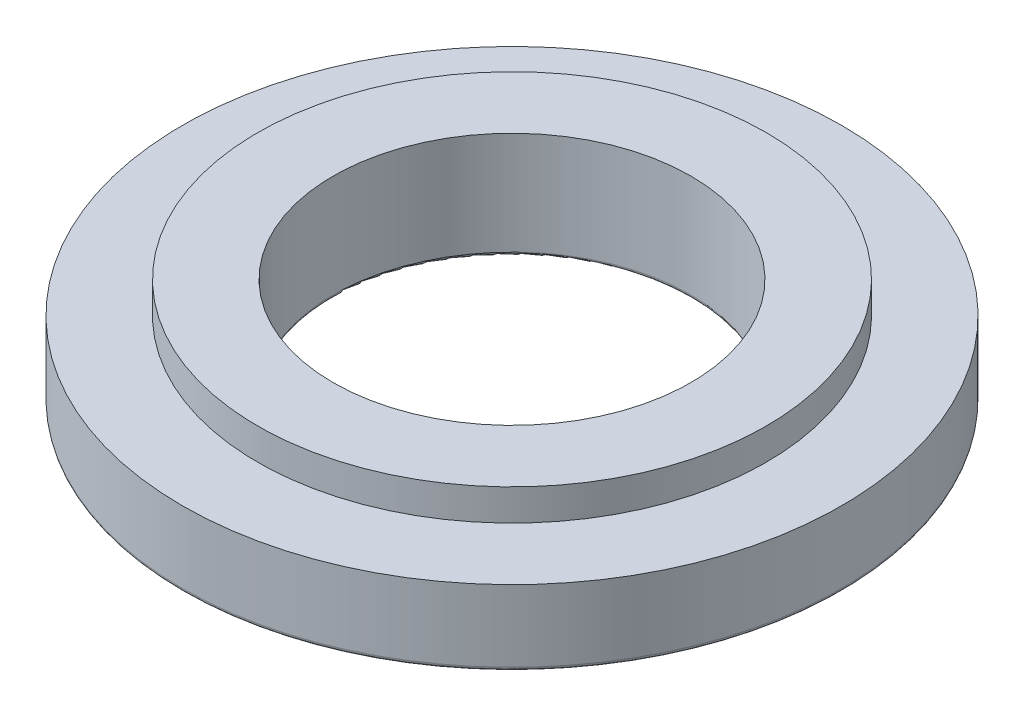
ISO-10303-21;
HEADER;
FILE_DESCRIPTION(('STEP AP214'),'2;1');
FILE_NAME('part.step','',(''),(''),'','','');
FILE_SCHEMA(('AUTOMOTIVE_DESIGN { 1 0 10303 214 1 1 1 1 }'));
ENDSEC;
DATA;
#1=APPLICATION_CONTEXT('core data for automotive mechanical design processes');
#2=APPLICATION_PROTOCOL_DEFINITION('international standard','automotive_design',2000,#1);
#3=PRODUCT_CONTEXT('',#1,'mechanical');
#4=PRODUCT('Part','Part','',(#3));
#5=PRODUCT_RELATED_PRODUCT_CATEGORY('part','',(#4));
#6=PRODUCT_DEFINITION_FORMATION('','',#4);
#7=PRODUCT_DEFINITION_CONTEXT('part definition',#1,'design');
#8=PRODUCT_DEFINITION('design','',#6,#7);
#9=PRODUCT_DEFINITION_SHAPE('','',#8);
#10=(LENGTH_UNIT() NAMED_UNIT(*) SI_UNIT(.MILLI.,.METRE.));
#11=(NAMED_UNIT(*) PLANE_ANGLE_UNIT() SI_UNIT($,.RADIAN.));
#12=(NAMED_UNIT(*) SI_UNIT($,.STERADIAN.) SOLID_ANGLE_UNIT());
#13=UNCERTAINTY_MEASURE_WITH_UNIT(LENGTH_MEASURE(1.E-05),#10,'distance_accuracy_value','');
#14=(GEOMETRIC_REPRESENTATION_CONTEXT(3) GLOBAL_UNCERTAINTY_ASSIGNED_CONTEXT((#13)) GLOBAL_UNIT_ASSIGNED_CONTEXT((#10,
#11,#12)) REPRESENTATION_CONTEXT('',''));
#15=CARTESIAN_POINT('',(0.,0.,0.));
#16=DIRECTION('',(0.,0.,1.));
#17=DIRECTION('',(1.,0.,0.));
#18=AXIS2_PLACEMENT_3D('',#15,#16,#17);
#19=CARTESIAN_POINT('',(13.125,0.,0.));
#20=DIRECTION('',(0.,-1.,0.));
#21=DIRECTION('',(0.,0.,-1.));
#22=AXIS2_PLACEMENT_3D('',#19,#20,#21);
#23=PLANE('',#22);
#24=CARTESIAN_POINT('',(0.,0.,0.));
#25=DIRECTION('',(0.,-1.,0.));
#26=DIRECTION('',(0.,0.,-1.));
#27=AXIS2_PLACEMENT_3D('',#24,#25,#26);
#28=CIRCLE('',#27,7.275);
#29=CARTESIAN_POINT('',(0.,0.,-7.275));
#30=VERTEX_POINT('',#29);
#31=EDGE_CURVE('E42',#30,#30,#28,.F.);
#32=ORIENTED_EDGE('',*,*,#31,.T.);
#33=EDGE_LOOP('',(#32));
#34=FACE_BOUND('',#33,.T.);
#35=CARTESIAN_POINT('',(0.,0.,0.));
#36=DIRECTION('',(0.,-1.,0.));
#37=DIRECTION('',(0.,0.,-1.));
#38=AXIS2_PLACEMENT_3D('',#35,#36,#37);
#39=CIRCLE('',#38,12.975);
#40=CARTESIAN_POINT('',(0.,0.,-12.975));
#41=VERTEX_POINT('',#40);
#42=EDGE_CURVE('E46',#41,#41,#39,.T.);
#43=ORIENTED_EDGE('',*,*,#42,.T.);
#44=EDGE_LOOP('',(#43));
#45=FACE_BOUND('',#44,.T.);
#46=ADVANCED_FACE('F35',(#34,#45),#23,.T.);
#47=CARTESIAN_POINT('',(0.,0.,0.));
#48=DIRECTION('',(0.,-1.,0.));
#49=DIRECTION('',(0.,0.,-1.));
#50=AXIS2_PLACEMENT_3D('',#47,#48,#49);
#51=CYLINDRICAL_SURFACE('',#50,7.125);
#52=CARTESIAN_POINT('',(0.,0.15,0.));
#53=DIRECTION('',(0.,-1.,0.));
#54=DIRECTION('',(0.,0.,-1.));
#55=AXIS2_PLACEMENT_3D('',#52,#53,#54);
#56=CIRCLE('',#55,7.125);
#57=CARTESIAN_POINT('',(0.,0.15,-7.125));
#58=VERTEX_POINT('',#57);
#59=EDGE_CURVE('E50',#58,#58,#56,.T.);
#60=ORIENTED_EDGE('',*,*,#59,.T.);
#61=EDGE_LOOP('',(#60));
#62=FACE_BOUND('',#61,.T.);
#63=CARTESIAN_POINT('',(0.,4.25,0.));
#64=DIRECTION('',(0.,-1.,0.));
#65=DIRECTION('',(0.,0.,-1.));
#66=AXIS2_PLACEMENT_3D('',#63,#64,#65);
#67=CIRCLE('',#66,7.125);
#68=CARTESIAN_POINT('',(0.,4.25,-7.125));
#69=VERTEX_POINT('',#68);
#70=EDGE_CURVE('E55',#69,#69,#67,.T.);
#71=ORIENTED_EDGE('',*,*,#70,.F.);
#72=EDGE_LOOP('',(#71));
#73=FACE_BOUND('',#72,.T.);
#74=ADVANCED_FACE('F85',(#62,#73),#51,.F.);
#75=CARTESIAN_POINT('',(7.125,4.25,0.));
#76=DIRECTION('',(0.,1.,0.));
#77=DIRECTION('',(0.,0.,1.));
#78=AXIS2_PLACEMENT_3D('',#75,#76,#77);
#79=PLANE('',#78);
#80=ORIENTED_EDGE('',*,*,#70,.T.);
#81=EDGE_LOOP('',(#80));
#82=FACE_BOUND('',#81,.T.);
#83=CARTESIAN_POINT('',(0.,4.25,0.));
#84=DIRECTION('',(0.,-1.,0.));
#85=DIRECTION('',(0.,0.,-1.));
#86=AXIS2_PLACEMENT_3D('',#83,#84,#85);
#87=CIRCLE('',#86,10.125);
#88=CARTESIAN_POINT('',(0.,4.25,-10.125));
#89=VERTEX_POINT('',#88);
#90=EDGE_CURVE('E58',#89,#89,#87,.T.);
#91=ORIENTED_EDGE('',*,*,#90,.F.);
#92=EDGE_LOOP('',(#91));
#93=FACE_BOUND('',#92,.T.);
#94=ADVANCED_FACE('F81',(#82,#93),#79,.T.);
#95=CARTESIAN_POINT('',(0.,0.,0.));
#96=DIRECTION('',(0.,-1.,0.));
#97=DIRECTION('',(0.,0.,-1.));
#98=AXIS2_PLACEMENT_3D('',#95,#96,#97);
#99=CYLINDRICAL_SURFACE('',#98,10.125);
#100=ORIENTED_EDGE('',*,*,#90,.T.);
#101=EDGE_LOOP('',(#100));
#102=FACE_BOUND('',#101,.T.);
#103=CARTESIAN_POINT('',(0.,3.,0.));
#104=DIRECTION('',(0.,-1.,0.));
#105=DIRECTION('',(0.,0.,-1.));
#106=AXIS2_PLACEMENT_3D('',#103,#104,#105);
#107=CIRCLE('',#106,10.125);
#108=CARTESIAN_POINT('',(0.,3.,-10.125));
#109=VERTEX_POINT('',#108);
#110=EDGE_CURVE('E61',#109,#109,#107,.T.);
#111=ORIENTED_EDGE('',*,*,#110,.F.);
#112=EDGE_LOOP('',(#111));
#113=FACE_BOUND('',#112,.T.);
#114=ADVANCED_FACE('F72',(#102,#113),#99,.T.);
#115=CARTESIAN_POINT('',(10.125,3.,0.));
#116=DIRECTION('',(0.,1.,0.));
#117=DIRECTION('',(0.,0.,1.));
#118=AXIS2_PLACEMENT_3D('',#115,#116,#117);
#119=PLANE('',#118);
#120=ORIENTED_EDGE('',*,*,#110,.T.);
#121=EDGE_LOOP('',(#120));
#122=FACE_BOUND('',#121,.T.);
#123=CARTESIAN_POINT('',(0.,3.,0.));
#124=DIRECTION('',(0.,-1.,0.));
#125=DIRECTION('',(0.,0.,-1.));
#126=AXIS2_PLACEMENT_3D('',#123,#124,#125);
#127=CIRCLE('',#126,13.125);
#128=CARTESIAN_POINT('',(0.,3.,-13.125));
#129=VERTEX_POINT('',#128);
#130=EDGE_CURVE('E64',#129,#129,#127,.T.);
#131=ORIENTED_EDGE('',*,*,#130,.F.);
#132=EDGE_LOOP('',(#131));
#133=FACE_BOUND('',#132,.T.);
#134=ADVANCED_FACE('F70',(#122,#133),#119,.T.);
#135=CARTESIAN_POINT('',(0.,0.,0.));
#136=DIRECTION('',(0.,-1.,0.));
#137=DIRECTION('',(0.,0.,-1.));
#138=AXIS2_PLACEMENT_3D('',#135,#136,#137);
#139=CYLINDRICAL_SURFACE('',#138,13.125);
#140=CARTESIAN_POINT('',(0.,0.15,0.));
#141=DIRECTION('',(0.,-1.,0.));
#142=DIRECTION('',(0.,0.,-1.));
#143=AXIS2_PLACEMENT_3D('',#140,#141,#142);
#144=CIRCLE('',#143,13.125);
#145=CARTESIAN_POINT('',(0.,0.15,-13.125));
#146=VERTEX_POINT('',#145);
#147=EDGE_CURVE('E10',#146,#146,#144,.F.);
#148=ORIENTED_EDGE('',*,*,#147,.T.);
#149=EDGE_LOOP('',(#148));
#150=FACE_BOUND('',#149,.T.);
#151=ORIENTED_EDGE('',*,*,#130,.T.);
#152=EDGE_LOOP('',(#151));
#153=FACE_BOUND('',#152,.T.);
#154=ADVANCED_FACE('F68',(#150,#153),#139,.T.);
#155=CARTESIAN_POINT('',(0.,0.15,0.));
#156=DIRECTION('',(0.,-1.,0.));
#157=DIRECTION('',(0.,0.,-1.));
#158=AXIS2_PLACEMENT_3D('',#155,#156,#157);
#159=TOROIDAL_SURFACE('',#158,7.275,0.15);
#160=ORIENTED_EDGE('',*,*,#31,.F.);
#161=EDGE_LOOP('',(#160));
#162=FACE_BOUND('',#161,.T.);
#163=ORIENTED_EDGE('',*,*,#59,.F.);
#164=EDGE_LOOP('',(#163));
#165=FACE_BOUND('',#164,.T.);
#166=ADVANCED_FACE('F79',(#162,#165),#159,.T.);
#167=CARTESIAN_POINT('',(0.,0.15,0.));
#168=DIRECTION('',(0.,-1.,0.));
#169=DIRECTION('',(0.,0.,-1.));
#170=AXIS2_PLACEMENT_3D('',#167,#168,#169);
#171=TOROIDAL_SURFACE('',#170,12.975,0.15);
#172=ORIENTED_EDGE('',*,*,#147,.F.);
#173=EDGE_LOOP('',(#172));
#174=FACE_BOUND('',#173,.T.);
#175=ORIENTED_EDGE('',*,*,#42,.F.);
#176=EDGE_LOOP('',(#175));
#177=FACE_BOUND('',#176,.T.);
#178=ADVANCED_FACE('F37',(#174,#177),#171,.T.);
#179=CLOSED_SHELL('',(#46,#74,#94,#114,#134,#154,#166,#178));
#180=MANIFOLD_SOLID_BREP('B2',#179);
#181=ADVANCED_BREP_SHAPE_REPRESENTATION('',(#18,#180),#14);
#182=SHAPE_DEFINITION_REPRESENTATION(#9,#181);
ENDSEC;
END-ISO-10303-21;
